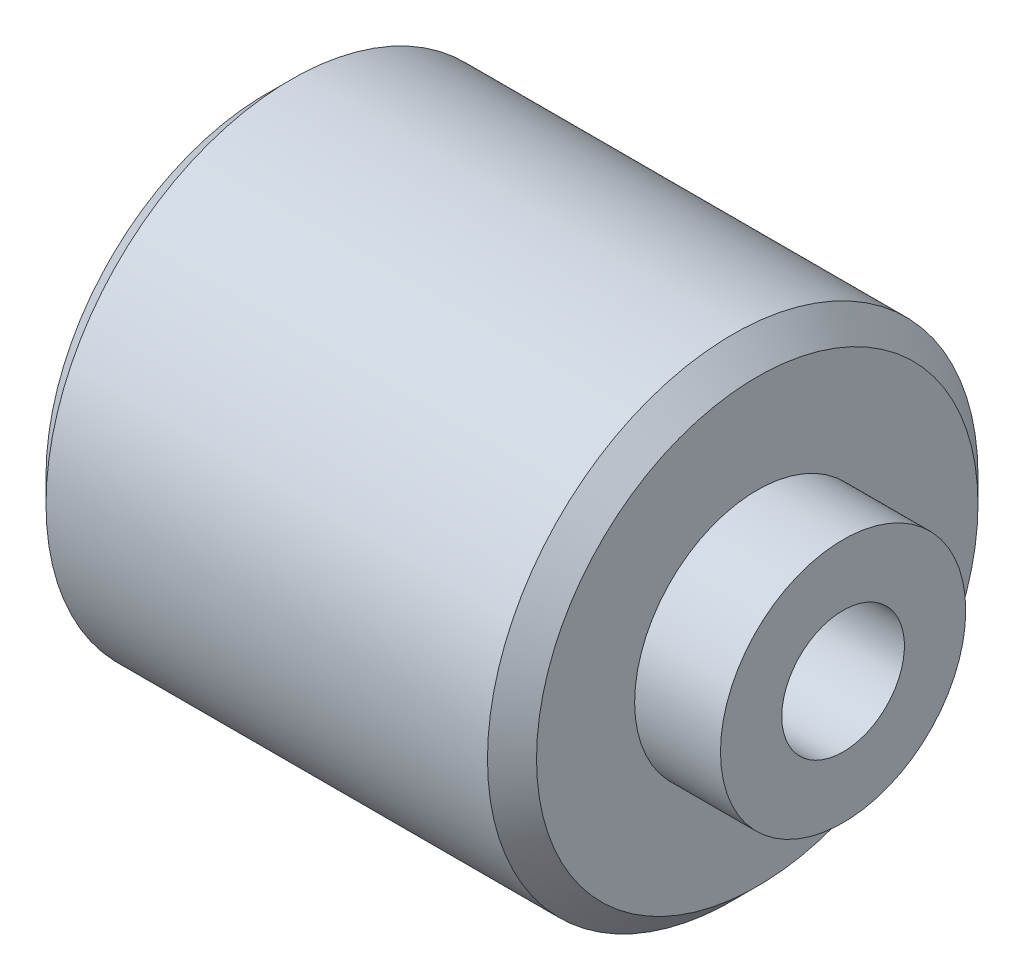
ISO-10303-21;
HEADER;
FILE_DESCRIPTION(('STEP AP214'),'2;1');
FILE_NAME('part.step','',(''),(''),'','','');
FILE_SCHEMA(('AUTOMOTIVE_DESIGN { 1 0 10303 214 1 1 1 1 }'));
ENDSEC;
DATA;
#1=APPLICATION_CONTEXT('core data for automotive mechanical design processes');
#2=APPLICATION_PROTOCOL_DEFINITION('international standard','automotive_design',2000,#1);
#3=PRODUCT_CONTEXT('',#1,'mechanical');
#4=PRODUCT('Part','Part','',(#3));
#5=PRODUCT_RELATED_PRODUCT_CATEGORY('part','',(#4));
#6=PRODUCT_DEFINITION_FORMATION('','',#4);
#7=PRODUCT_DEFINITION_CONTEXT('part definition',#1,'design');
#8=PRODUCT_DEFINITION('design','',#6,#7);
#9=PRODUCT_DEFINITION_SHAPE('','',#8);
#10=(LENGTH_UNIT() NAMED_UNIT(*) SI_UNIT(.MILLI.,.METRE.));
#11=(NAMED_UNIT(*) PLANE_ANGLE_UNIT() SI_UNIT($,.RADIAN.));
#12=(NAMED_UNIT(*) SI_UNIT($,.STERADIAN.) SOLID_ANGLE_UNIT());
#13=UNCERTAINTY_MEASURE_WITH_UNIT(LENGTH_MEASURE(1.E-05),#10,'distance_accuracy_value','');
#14=(GEOMETRIC_REPRESENTATION_CONTEXT(3) GLOBAL_UNCERTAINTY_ASSIGNED_CONTEXT((#13)) GLOBAL_UNIT_ASSIGNED_CONTEXT((#10,
#11,#12)) REPRESENTATION_CONTEXT('',''));
#15=CARTESIAN_POINT('',(0.,0.,0.));
#16=DIRECTION('',(0.,0.,1.));
#17=DIRECTION('',(1.,0.,0.));
#18=AXIS2_PLACEMENT_3D('',#15,#16,#17);
#19=CARTESIAN_POINT('',(0.,0.,-9.));
#20=DIRECTION('',(1.,0.,0.));
#21=DIRECTION('',(0.,0.,-1.));
#22=AXIS2_PLACEMENT_3D('',#19,#20,#21);
#23=PLANE('',#22);
#24=CARTESIAN_POINT('',(0.,0.,0.));
#25=DIRECTION('',(-1.,0.,0.));
#26=DIRECTION('',(0.,0.,1.));
#27=AXIS2_PLACEMENT_3D('',#24,#25,#26);
#28=CIRCLE('',#27,2.5);
#29=CARTESIAN_POINT('',(0.,0.,2.5));
#30=VERTEX_POINT('',#29);
#31=EDGE_CURVE('E10',#30,#30,#28,.T.);
#32=ORIENTED_EDGE('',*,*,#31,.F.);
#33=EDGE_LOOP('',(#32));
#34=FACE_BOUND('',#33,.T.);
#35=CARTESIAN_POINT('',(0.,0.,0.));
#36=DIRECTION('',(-1.,0.,0.));
#37=DIRECTION('',(0.,0.,1.));
#38=AXIS2_PLACEMENT_3D('',#35,#36,#37);
#39=CIRCLE('',#38,9.);
#40=CARTESIAN_POINT('',(0.,0.,9.));
#41=VERTEX_POINT('',#40);
#42=EDGE_CURVE('E56',#41,#41,#39,.T.);
#43=ORIENTED_EDGE('',*,*,#42,.T.);
#44=EDGE_LOOP('',(#43));
#45=FACE_BOUND('',#44,.T.);
#46=ADVANCED_FACE('F28',(#34,#45),#23,.F.);
#47=CARTESIAN_POINT('',(0.,0.,0.));
#48=DIRECTION('',(-1.,0.,0.));
#49=DIRECTION('',(0.,0.,1.));
#50=AXIS2_PLACEMENT_3D('',#47,#48,#49);
#51=CYLINDRICAL_SURFACE('',#50,2.5);
#52=CARTESIAN_POINT('',(23.5,0.,0.));
#53=DIRECTION('',(-1.,0.,0.));
#54=DIRECTION('',(0.,0.,1.));
#55=AXIS2_PLACEMENT_3D('',#52,#53,#54);
#56=CIRCLE('',#55,2.5);
#57=CARTESIAN_POINT('',(23.5,0.,2.5));
#58=VERTEX_POINT('',#57);
#59=EDGE_CURVE('E34',#58,#58,#56,.T.);
#60=ORIENTED_EDGE('',*,*,#59,.F.);
#61=EDGE_LOOP('',(#60));
#62=FACE_BOUND('',#61,.T.);
#63=ORIENTED_EDGE('',*,*,#31,.T.);
#64=EDGE_LOOP('',(#63));
#65=FACE_BOUND('',#64,.T.);
#66=ADVANCED_FACE('F93',(#62,#65),#51,.F.);
#67=CARTESIAN_POINT('',(23.5,0.,-2.5));
#68=DIRECTION('',(-1.,0.,0.));
#69=DIRECTION('',(0.,0.,1.));
#70=AXIS2_PLACEMENT_3D('',#67,#68,#69);
#71=PLANE('',#70);
#72=CARTESIAN_POINT('',(23.5,0.,0.));
#73=DIRECTION('',(-1.,0.,0.));
#74=DIRECTION('',(0.,0.,1.));
#75=AXIS2_PLACEMENT_3D('',#72,#73,#74);
#76=CIRCLE('',#75,5.);
#77=CARTESIAN_POINT('',(23.5,0.,5.));
#78=VERTEX_POINT('',#77);
#79=EDGE_CURVE('E38',#78,#78,#76,.T.);
#80=ORIENTED_EDGE('',*,*,#79,.F.);
#81=EDGE_LOOP('',(#80));
#82=FACE_BOUND('',#81,.T.);
#83=ORIENTED_EDGE('',*,*,#59,.T.);
#84=EDGE_LOOP('',(#83));
#85=FACE_BOUND('',#84,.T.);
#86=ADVANCED_FACE('F88',(#82,#85),#71,.F.);
#87=CARTESIAN_POINT('',(0.,0.,0.));
#88=DIRECTION('',(-1.,0.,0.));
#89=DIRECTION('',(0.,0.,1.));
#90=AXIS2_PLACEMENT_3D('',#87,#88,#89);
#91=CYLINDRICAL_SURFACE('',#90,5.);
#92=CARTESIAN_POINT('',(20.,0.,0.));
#93=DIRECTION('',(-1.,0.,0.));
#94=DIRECTION('',(0.,0.,1.));
#95=AXIS2_PLACEMENT_3D('',#92,#93,#94);
#96=CIRCLE('',#95,5.);
#97=CARTESIAN_POINT('',(20.,0.,5.));
#98=VERTEX_POINT('',#97);
#99=EDGE_CURVE('E42',#98,#98,#96,.T.);
#100=ORIENTED_EDGE('',*,*,#99,.F.);
#101=EDGE_LOOP('',(#100));
#102=FACE_BOUND('',#101,.T.);
#103=ORIENTED_EDGE('',*,*,#79,.T.);
#104=EDGE_LOOP('',(#103));
#105=FACE_BOUND('',#104,.T.);
#106=ADVANCED_FACE('F82',(#102,#105),#91,.T.);
#107=CARTESIAN_POINT('',(20.,0.,-5.));
#108=DIRECTION('',(-1.,0.,0.));
#109=DIRECTION('',(0.,0.,1.));
#110=AXIS2_PLACEMENT_3D('',#107,#108,#109);
#111=PLANE('',#110);
#112=CARTESIAN_POINT('',(20.,0.,0.));
#113=DIRECTION('',(-1.,0.,0.));
#114=DIRECTION('',(0.,0.,1.));
#115=AXIS2_PLACEMENT_3D('',#112,#113,#114);
#116=CIRCLE('',#115,9.);
#117=CARTESIAN_POINT('',(20.,0.,9.));
#118=VERTEX_POINT('',#117);
#119=EDGE_CURVE('E47',#118,#118,#116,.T.);
#120=ORIENTED_EDGE('',*,*,#119,.F.);
#121=EDGE_LOOP('',(#120));
#122=FACE_BOUND('',#121,.T.);
#123=ORIENTED_EDGE('',*,*,#99,.T.);
#124=EDGE_LOOP('',(#123));
#125=FACE_BOUND('',#124,.T.);
#126=ADVANCED_FACE('F76',(#122,#125),#111,.F.);
#127=CARTESIAN_POINT('',(20.,0.,0.));
#128=DIRECTION('',(-1.,0.,0.));
#129=DIRECTION('',(0.,0.,1.));
#130=AXIS2_PLACEMENT_3D('',#127,#128,#129);
#131=CONICAL_SURFACE('',#130,9.,0.785398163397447);
#132=CARTESIAN_POINT('',(19.,0.,0.));
#133=DIRECTION('',(-1.,0.,0.));
#134=DIRECTION('',(0.,0.,1.));
#135=AXIS2_PLACEMENT_3D('',#132,#133,#134);
#136=CIRCLE('',#135,10.);
#137=CARTESIAN_POINT('',(19.,0.,10.));
#138=VERTEX_POINT('',#137);
#139=EDGE_CURVE('E50',#138,#138,#136,.T.);
#140=ORIENTED_EDGE('',*,*,#139,.F.);
#141=EDGE_LOOP('',(#140));
#142=FACE_BOUND('',#141,.T.);
#143=ORIENTED_EDGE('',*,*,#119,.T.);
#144=EDGE_LOOP('',(#143));
#145=FACE_BOUND('',#144,.T.);
#146=ADVANCED_FACE('F70',(#142,#145),#131,.T.);
#147=CARTESIAN_POINT('',(0.,0.,0.));
#148=DIRECTION('',(-1.,0.,0.));
#149=DIRECTION('',(0.,0.,1.));
#150=AXIS2_PLACEMENT_3D('',#147,#148,#149);
#151=CYLINDRICAL_SURFACE('',#150,10.);
#152=CARTESIAN_POINT('',(1.,0.,0.));
#153=DIRECTION('',(-1.,0.,0.));
#154=DIRECTION('',(0.,0.,1.));
#155=AXIS2_PLACEMENT_3D('',#152,#153,#154);
#156=CIRCLE('',#155,10.);
#157=CARTESIAN_POINT('',(1.,0.,10.));
#158=VERTEX_POINT('',#157);
#159=EDGE_CURVE('E53',#158,#158,#156,.T.);
#160=ORIENTED_EDGE('',*,*,#159,.F.);
#161=EDGE_LOOP('',(#160));
#162=FACE_BOUND('',#161,.T.);
#163=ORIENTED_EDGE('',*,*,#139,.T.);
#164=EDGE_LOOP('',(#163));
#165=FACE_BOUND('',#164,.T.);
#166=ADVANCED_FACE('F64',(#162,#165),#151,.T.);
#167=CARTESIAN_POINT('',(1.,0.,0.));
#168=DIRECTION('',(1.,0.,0.));
#169=DIRECTION('',(0.,0.,-1.));
#170=AXIS2_PLACEMENT_3D('',#167,#168,#169);
#171=CONICAL_SURFACE('',#170,10.,0.785398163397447);
#172=ORIENTED_EDGE('',*,*,#42,.F.);
#173=EDGE_LOOP('',(#172));
#174=FACE_BOUND('',#173,.T.);
#175=ORIENTED_EDGE('',*,*,#159,.T.);
#176=EDGE_LOOP('',(#175));
#177=FACE_BOUND('',#176,.T.);
#178=ADVANCED_FACE('F61',(#174,#177),#171,.T.);
#179=CLOSED_SHELL('',(#46,#66,#86,#106,#126,#146,#166,#178));
#180=MANIFOLD_SOLID_BREP('B2',#179);
#181=ADVANCED_BREP_SHAPE_REPRESENTATION('',(#18,#180),#14);
#182=SHAPE_DEFINITION_REPRESENTATION(#9,#181);
ENDSEC;
END-ISO-10303-21;
